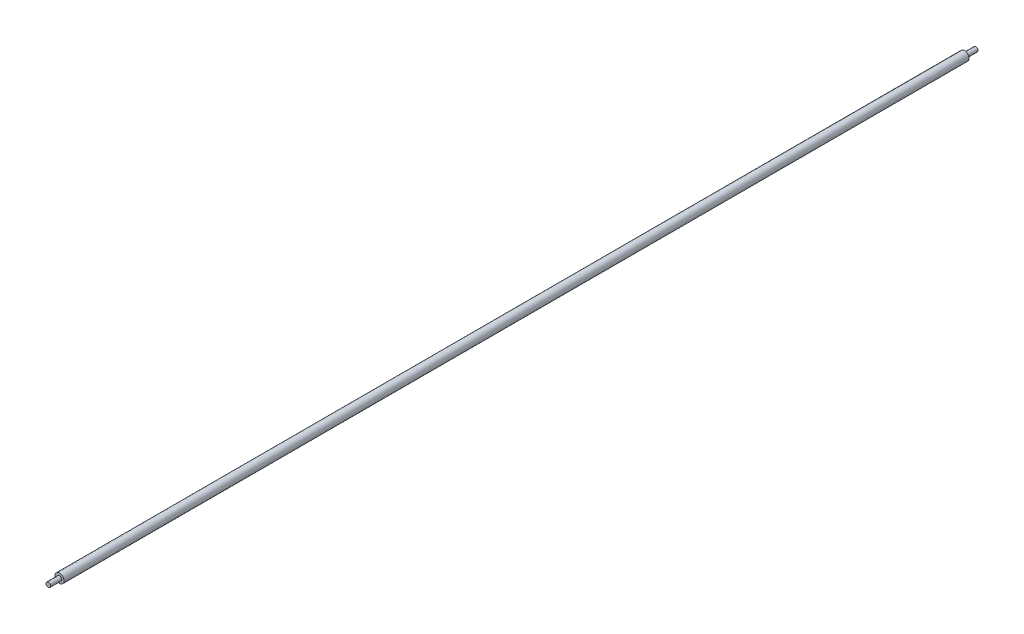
ISO-10303-21;
HEADER;
FILE_DESCRIPTION(('STEP AP214'),'2;1');
FILE_NAME('part.step','',(''),(''),'','','');
FILE_SCHEMA(('AUTOMOTIVE_DESIGN { 1 0 10303 214 1 1 1 1 }'));
ENDSEC;
DATA;
#1=APPLICATION_CONTEXT('core data for automotive mechanical design processes');
#2=APPLICATION_PROTOCOL_DEFINITION('international standard','automotive_design',2000,#1);
#3=PRODUCT_CONTEXT('',#1,'mechanical');
#4=PRODUCT('Part','Part','',(#3));
#5=PRODUCT_RELATED_PRODUCT_CATEGORY('part','',(#4));
#6=PRODUCT_DEFINITION_FORMATION('','',#4);
#7=PRODUCT_DEFINITION_CONTEXT('part definition',#1,'design');
#8=PRODUCT_DEFINITION('design','',#6,#7);
#9=PRODUCT_DEFINITION_SHAPE('','',#8);
#10=(LENGTH_UNIT() NAMED_UNIT(*) SI_UNIT(.MILLI.,.METRE.));
#11=(NAMED_UNIT(*) PLANE_ANGLE_UNIT() SI_UNIT($,.RADIAN.));
#12=(NAMED_UNIT(*) SI_UNIT($,.STERADIAN.) SOLID_ANGLE_UNIT());
#13=UNCERTAINTY_MEASURE_WITH_UNIT(LENGTH_MEASURE(1.E-05),#10,'distance_accuracy_value','');
#14=(GEOMETRIC_REPRESENTATION_CONTEXT(3) GLOBAL_UNCERTAINTY_ASSIGNED_CONTEXT((#13)) GLOBAL_UNIT_ASSIGNED_CONTEXT((#10,
#11,#12)) REPRESENTATION_CONTEXT('',''));
#15=CARTESIAN_POINT('',(0.,0.,0.));
#16=DIRECTION('',(0.,0.,1.));
#17=DIRECTION('',(1.,0.,0.));
#18=AXIS2_PLACEMENT_3D('',#15,#16,#17);
#19=CARTESIAN_POINT('',(0.,0.,0.));
#20=DIRECTION('',(0.,0.,1.));
#21=DIRECTION('',(1.,0.,0.));
#22=AXIS2_PLACEMENT_3D('',#19,#20,#21);
#23=PLANE('',#22);
#24=CARTESIAN_POINT('',(0.,0.,0.));
#25=DIRECTION('',(0.,0.,1.));
#26=DIRECTION('',(1.,0.,0.));
#27=AXIS2_PLACEMENT_3D('',#24,#25,#26);
#28=CIRCLE('',#27,5.08);
#29=CARTESIAN_POINT('',(5.08,0.,0.));
#30=VERTEX_POINT('',#29);
#31=EDGE_CURVE('E42',#30,#30,#28,.T.);
#32=ORIENTED_EDGE('',*,*,#31,.F.);
#33=EDGE_LOOP('',(#32));
#34=FACE_BOUND('',#33,.T.);
#35=CARTESIAN_POINT('',(0.,0.,0.));
#36=DIRECTION('',(0.,0.,1.));
#37=DIRECTION('',(1.,0.,0.));
#38=AXIS2_PLACEMENT_3D('',#35,#36,#37);
#39=CIRCLE('',#38,2.54);
#40=CARTESIAN_POINT('',(2.54,0.,0.));
#41=VERTEX_POINT('',#40);
#42=EDGE_CURVE('E10',#41,#41,#39,.F.);
#43=ORIENTED_EDGE('',*,*,#42,.F.);
#44=EDGE_LOOP('',(#43));
#45=FACE_BOUND('',#44,.T.);
#46=ADVANCED_FACE('F31',(#34,#45),#23,.F.);
#47=CARTESIAN_POINT('',(0.,0.,1020.));
#48=DIRECTION('',(0.,0.,1.));
#49=DIRECTION('',(1.,0.,0.));
#50=AXIS2_PLACEMENT_3D('',#47,#48,#49);
#51=PLANE('',#50);
#52=CARTESIAN_POINT('',(0.,0.,1020.));
#53=DIRECTION('',(0.,0.,1.));
#54=DIRECTION('',(1.,0.,0.));
#55=AXIS2_PLACEMENT_3D('',#52,#53,#54);
#56=CIRCLE('',#55,5.08);
#57=CARTESIAN_POINT('',(5.08,0.,1020.));
#58=VERTEX_POINT('',#57);
#59=EDGE_CURVE('E38',#58,#58,#56,.T.);
#60=ORIENTED_EDGE('',*,*,#59,.T.);
#61=EDGE_LOOP('',(#60));
#62=FACE_BOUND('',#61,.T.);
#63=CARTESIAN_POINT('',(0.,0.,1020.));
#64=DIRECTION('',(0.,0.,1.));
#65=DIRECTION('',(1.,0.,0.));
#66=AXIS2_PLACEMENT_3D('',#63,#64,#65);
#67=CIRCLE('',#66,2.54);
#68=CARTESIAN_POINT('',(2.54,0.,1020.));
#69=VERTEX_POINT('',#68);
#70=EDGE_CURVE('E49',#69,#69,#67,.T.);
#71=ORIENTED_EDGE('',*,*,#70,.F.);
#72=EDGE_LOOP('',(#71));
#73=FACE_BOUND('',#72,.T.);
#74=ADVANCED_FACE('F73',(#62,#73),#51,.T.);
#75=CARTESIAN_POINT('',(0.,0.,1020.));
#76=DIRECTION('',(0.,0.,-1.));
#77=DIRECTION('',(-1.,0.,0.));
#78=AXIS2_PLACEMENT_3D('',#75,#76,#77);
#79=CYLINDRICAL_SURFACE('',#78,5.08);
#80=ORIENTED_EDGE('',*,*,#59,.F.);
#81=EDGE_LOOP('',(#80));
#82=FACE_BOUND('',#81,.T.);
#83=ORIENTED_EDGE('',*,*,#31,.T.);
#84=EDGE_LOOP('',(#83));
#85=FACE_BOUND('',#84,.T.);
#86=ADVANCED_FACE('F33',(#82,#85),#79,.T.);
#87=CARTESIAN_POINT('',(0.,0.,1032.7));
#88=DIRECTION('',(0.,0.,-1.));
#89=DIRECTION('',(-1.,0.,0.));
#90=AXIS2_PLACEMENT_3D('',#87,#88,#89);
#91=CYLINDRICAL_SURFACE('',#90,2.54);
#92=CARTESIAN_POINT('',(0.,0.,1032.7));
#93=DIRECTION('',(0.,0.,1.));
#94=DIRECTION('',(1.,0.,0.));
#95=AXIS2_PLACEMENT_3D('',#92,#93,#94);
#96=CIRCLE('',#95,2.54);
#97=CARTESIAN_POINT('',(2.54,0.,1032.7));
#98=VERTEX_POINT('',#97);
#99=EDGE_CURVE('E47',#98,#98,#96,.T.);
#100=ORIENTED_EDGE('',*,*,#99,.F.);
#101=EDGE_LOOP('',(#100));
#102=FACE_BOUND('',#101,.T.);
#103=ORIENTED_EDGE('',*,*,#70,.T.);
#104=EDGE_LOOP('',(#103));
#105=FACE_BOUND('',#104,.T.);
#106=ADVANCED_FACE('F69',(#102,#105),#91,.T.);
#107=CARTESIAN_POINT('',(0.,0.,1032.7));
#108=DIRECTION('',(0.,0.,1.));
#109=DIRECTION('',(1.,0.,0.));
#110=AXIS2_PLACEMENT_3D('',#107,#108,#109);
#111=PLANE('',#110);
#112=ORIENTED_EDGE('',*,*,#99,.T.);
#113=EDGE_LOOP('',(#112));
#114=FACE_BOUND('',#113,.T.);
#115=ADVANCED_FACE('F62',(#114),#111,.T.);
#116=CARTESIAN_POINT('',(0.,0.,-12.7));
#117=DIRECTION('',(0.,0.,1.));
#118=DIRECTION('',(1.,0.,0.));
#119=AXIS2_PLACEMENT_3D('',#116,#117,#118);
#120=CYLINDRICAL_SURFACE('',#119,2.54);
#121=CARTESIAN_POINT('',(0.,0.,-12.7));
#122=DIRECTION('',(0.,0.,-1.));
#123=DIRECTION('',(-1.,0.,0.));
#124=AXIS2_PLACEMENT_3D('',#121,#122,#123);
#125=CIRCLE('',#124,2.54);
#126=CARTESIAN_POINT('',(-2.54,0.,-12.7));
#127=VERTEX_POINT('',#126);
#128=EDGE_CURVE('E52',#127,#127,#125,.T.);
#129=ORIENTED_EDGE('',*,*,#128,.F.);
#130=EDGE_LOOP('',(#129));
#131=FACE_BOUND('',#130,.T.);
#132=ORIENTED_EDGE('',*,*,#42,.T.);
#133=EDGE_LOOP('',(#132));
#134=FACE_BOUND('',#133,.T.);
#135=ADVANCED_FACE('F60',(#131,#134),#120,.T.);
#136=CARTESIAN_POINT('',(0.,0.,-12.7));
#137=DIRECTION('',(0.,0.,-1.));
#138=DIRECTION('',(-1.,0.,0.));
#139=AXIS2_PLACEMENT_3D('',#136,#137,#138);
#140=PLANE('',#139);
#141=ORIENTED_EDGE('',*,*,#128,.T.);
#142=EDGE_LOOP('',(#141));
#143=FACE_BOUND('',#142,.T.);
#144=ADVANCED_FACE('F58',(#143),#140,.T.);
#145=CLOSED_SHELL('',(#46,#74,#86,#106,#115,#135,#144));
#146=MANIFOLD_SOLID_BREP('B2',#145);
#147=ADVANCED_BREP_SHAPE_REPRESENTATION('',(#18,#146),#14);
#148=SHAPE_DEFINITION_REPRESENTATION(#9,#147);
ENDSEC;
END-ISO-10303-21;
